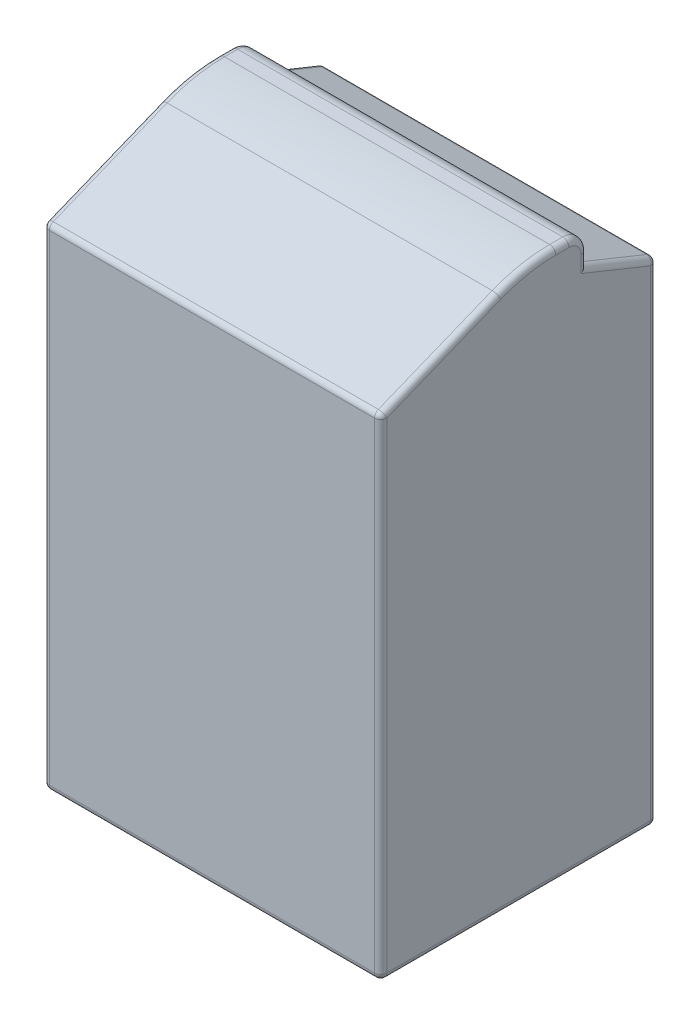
ISO-10303-21;
HEADER;
FILE_DESCRIPTION(('STEP AP214'),'2;1');
FILE_NAME('part.step','',(''),(''),'','','');
FILE_SCHEMA(('AUTOMOTIVE_DESIGN { 1 0 10303 214 1 1 1 1 }'));
ENDSEC;
DATA;
#1=APPLICATION_CONTEXT('core data for automotive mechanical design processes');
#2=APPLICATION_PROTOCOL_DEFINITION('international standard','automotive_design',2000,#1);
#3=PRODUCT_CONTEXT('',#1,'mechanical');
#4=PRODUCT('Part','Part','',(#3));
#5=PRODUCT_RELATED_PRODUCT_CATEGORY('part','',(#4));
#6=PRODUCT_DEFINITION_FORMATION('','',#4);
#7=PRODUCT_DEFINITION_CONTEXT('part definition',#1,'design');
#8=PRODUCT_DEFINITION('design','',#6,#7);
#9=PRODUCT_DEFINITION_SHAPE('','',#8);
#10=(LENGTH_UNIT() NAMED_UNIT(*) SI_UNIT(.MILLI.,.METRE.));
#11=(NAMED_UNIT(*) PLANE_ANGLE_UNIT() SI_UNIT($,.RADIAN.));
#12=(NAMED_UNIT(*) SI_UNIT($,.STERADIAN.) SOLID_ANGLE_UNIT());
#13=UNCERTAINTY_MEASURE_WITH_UNIT(LENGTH_MEASURE(1.E-05),#10,'distance_accuracy_value','');
#14=(GEOMETRIC_REPRESENTATION_CONTEXT(3) GLOBAL_UNCERTAINTY_ASSIGNED_CONTEXT((#13)) GLOBAL_UNIT_ASSIGNED_CONTEXT((#10,
#11,#12)) REPRESENTATION_CONTEXT('',''));
#15=CARTESIAN_POINT('',(0.,0.,0.));
#16=DIRECTION('',(0.,0.,1.));
#17=DIRECTION('',(1.,0.,0.));
#18=AXIS2_PLACEMENT_3D('',#15,#16,#17);
#19=CARTESIAN_POINT('',(27.5,80.,22.5));
#20=DIRECTION('',(0.,0.,-1.));
#21=DIRECTION('',(0.,1.,0.));
#22=AXIS2_PLACEMENT_3D('',#19,#20,#21);
#23=PLANE('',#22);
#24=DIRECTION('',(0.,-1.,0.));
#25=VECTOR('',#24,1.);
#26=CARTESIAN_POINT('',(26.5,80.,22.5));
#27=LINE('',#26,#25);
#28=CARTESIAN_POINT('',(26.5,1.,22.5000000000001));
#29=VERTEX_POINT('',#28);
#30=CARTESIAN_POINT('',(26.5,79.3254914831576,22.5));
#31=VERTEX_POINT('',#30);
#32=EDGE_CURVE('E294',#29,#31,#27,.F.);
#33=ORIENTED_EDGE('',*,*,#32,.T.);
#34=DIRECTION('',(-1.,0.,0.));
#35=VECTOR('',#34,1.);
#36=CARTESIAN_POINT('',(27.5,79.3254914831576,22.5));
#37=LINE('',#36,#35);
#38=CARTESIAN_POINT('',(-26.5,79.3254914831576,22.5));
#39=VERTEX_POINT('',#38);
#40=EDGE_CURVE('E296',#31,#39,#37,.T.);
#41=ORIENTED_EDGE('',*,*,#40,.T.);
#42=DIRECTION('',(0.,-1.,0.));
#43=VECTOR('',#42,1.);
#44=CARTESIAN_POINT('',(-26.5,0.,22.5000000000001));
#45=LINE('',#44,#43);
#46=CARTESIAN_POINT('',(-26.5,1.,22.5000000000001));
#47=VERTEX_POINT('',#46);
#48=EDGE_CURVE('E292',#39,#47,#45,.T.);
#49=ORIENTED_EDGE('',*,*,#48,.T.);
#50=DIRECTION('',(-1.,0.,0.));
#51=VECTOR('',#50,1.);
#52=CARTESIAN_POINT('',(27.5,1.,22.5000000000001));
#53=LINE('',#52,#51);
#54=EDGE_CURVE('E290',#47,#29,#53,.F.);
#55=ORIENTED_EDGE('',*,*,#54,.T.);
#56=EDGE_LOOP('',(#33,#41,#49,#55));
#57=FACE_BOUND('',#56,.T.);
#58=ADVANCED_FACE('F36',(#57),#23,.F.);
#59=CARTESIAN_POINT('',(27.5,0.,22.5000000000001));
#60=DIRECTION('',(0.,1.,0.));
#61=DIRECTION('',(0.,0.,1.));
#62=AXIS2_PLACEMENT_3D('',#59,#60,#61);
#63=PLANE('',#62);
#64=DIRECTION('',(0.,0.,-1.));
#65=VECTOR('',#64,1.);
#66=CARTESIAN_POINT('',(26.5,0.,22.5000000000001));
#67=LINE('',#66,#65);
#68=CARTESIAN_POINT('',(26.5,0.,-21.5));
#69=VERTEX_POINT('',#68);
#70=CARTESIAN_POINT('',(26.5,0.,21.5000000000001));
#71=VERTEX_POINT('',#70);
#72=EDGE_CURVE('E45',#69,#71,#67,.F.);
#73=ORIENTED_EDGE('',*,*,#72,.T.);
#74=DIRECTION('',(-1.,0.,0.));
#75=VECTOR('',#74,1.);
#76=CARTESIAN_POINT('',(27.5,0.,21.5000000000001));
#77=LINE('',#76,#75);
#78=CARTESIAN_POINT('',(-26.5,0.,21.5000000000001));
#79=VERTEX_POINT('',#78);
#80=EDGE_CURVE('E11',#71,#79,#77,.T.);
#81=ORIENTED_EDGE('',*,*,#80,.T.);
#82=DIRECTION('',(0.,0.,-1.));
#83=VECTOR('',#82,1.);
#84=CARTESIAN_POINT('',(-26.5,0.,-22.5));
#85=LINE('',#84,#83);
#86=CARTESIAN_POINT('',(-26.5,0.,-21.5));
#87=VERTEX_POINT('',#86);
#88=EDGE_CURVE('E299',#79,#87,#85,.T.);
#89=ORIENTED_EDGE('',*,*,#88,.T.);
#90=DIRECTION('',(-1.,0.,0.));
#91=VECTOR('',#90,1.);
#92=CARTESIAN_POINT('',(27.5,0.,-21.5));
#93=LINE('',#92,#91);
#94=EDGE_CURVE('E56',#87,#69,#93,.F.);
#95=ORIENTED_EDGE('',*,*,#94,.T.);
#96=EDGE_LOOP('',(#73,#81,#89,#95));
#97=FACE_BOUND('',#96,.T.);
#98=ADVANCED_FACE('F479',(#97),#63,.F.);
#99=CARTESIAN_POINT('',(27.5,80.,-22.5));
#100=DIRECTION('',(0.,0.,1.));
#101=DIRECTION('',(0.,-1.,0.));
#102=AXIS2_PLACEMENT_3D('',#99,#100,#101);
#103=PLANE('',#102);
#104=DIRECTION('',(-1.,0.,0.));
#105=VECTOR('',#104,1.);
#106=CARTESIAN_POINT('',(27.5,79.3254914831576,-22.5));
#107=LINE('',#106,#105);
#108=CARTESIAN_POINT('',(-26.5,79.3254914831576,-22.5));
#109=VERTEX_POINT('',#108);
#110=CARTESIAN_POINT('',(26.5,79.3254914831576,-22.5));
#111=VERTEX_POINT('',#110);
#112=EDGE_CURVE('E285',#109,#111,#107,.F.);
#113=ORIENTED_EDGE('',*,*,#112,.T.);
#114=DIRECTION('',(0.,1.,0.));
#115=VECTOR('',#114,1.);
#116=CARTESIAN_POINT('',(26.5,80.,-22.5));
#117=LINE('',#116,#115);
#118=CARTESIAN_POINT('',(26.5,1.,-22.5));
#119=VERTEX_POINT('',#118);
#120=EDGE_CURVE('E287',#111,#119,#117,.F.);
#121=ORIENTED_EDGE('',*,*,#120,.T.);
#122=DIRECTION('',(-1.,0.,0.));
#123=VECTOR('',#122,1.);
#124=CARTESIAN_POINT('',(27.5,1.,-22.5));
#125=LINE('',#124,#123);
#126=CARTESIAN_POINT('',(-26.5,1.,-22.5));
#127=VERTEX_POINT('',#126);
#128=EDGE_CURVE('E281',#119,#127,#125,.T.);
#129=ORIENTED_EDGE('',*,*,#128,.T.);
#130=DIRECTION('',(0.,1.,0.));
#131=VECTOR('',#130,1.);
#132=CARTESIAN_POINT('',(-26.5,80.,-22.5));
#133=LINE('',#132,#131);
#134=EDGE_CURVE('E283',#127,#109,#133,.T.);
#135=ORIENTED_EDGE('',*,*,#134,.T.);
#136=EDGE_LOOP('',(#113,#121,#129,#135));
#137=FACE_BOUND('',#136,.T.);
#138=ADVANCED_FACE('F460',(#137),#103,.F.);
#139=CARTESIAN_POINT('',(27.5,84.5704589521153,-11.1877171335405));
#140=DIRECTION('',(0.,-0.927183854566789,0.374606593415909));
#141=DIRECTION('',(0.,-0.374606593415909,-0.927183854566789));
#142=AXIS2_PLACEMENT_3D('',#139,#140,#141);
#143=PLANE('',#142);
#144=DIRECTION('',(-1.,0.,0.));
#145=VECTOR('',#144,1.);
#146=CARTESIAN_POINT('',(27.5,80.2526753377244,-21.8746065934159));
#147=LINE('',#146,#145);
#148=CARTESIAN_POINT('',(26.5,80.2526753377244,-21.8746065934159));
#149=VERTEX_POINT('',#148);
#150=CARTESIAN_POINT('',(-26.5,80.2526753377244,-21.8746065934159));
#151=VERTEX_POINT('',#150);
#152=EDGE_CURVE('E206',#149,#151,#147,.T.);
#153=ORIENTED_EDGE('',*,*,#152,.T.);
#154=DIRECTION('',(0.,0.374606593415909,0.927183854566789));
#155=VECTOR('',#154,1.);
#156=CARTESIAN_POINT('',(-26.5,84.5704589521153,-11.1877171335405));
#157=LINE('',#156,#155);
#158=CARTESIAN_POINT('',(-26.5,84.5704589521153,-11.1877171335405));
#159=VERTEX_POINT('',#158);
#160=EDGE_CURVE('E205',#151,#159,#157,.T.);
#161=ORIENTED_EDGE('',*,*,#160,.T.);
#162=DIRECTION('',(-1.,0.,0.));
#163=VECTOR('',#162,1.);
#164=CARTESIAN_POINT('',(27.5,84.5704589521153,-11.1877171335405));
#165=LINE('',#164,#163);
#166=CARTESIAN_POINT('',(26.5,84.5704589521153,-11.1877171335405));
#167=VERTEX_POINT('',#166);
#168=EDGE_CURVE('E188',#167,#159,#165,.T.);
#169=ORIENTED_EDGE('',*,*,#168,.F.);
#170=DIRECTION('',(0.,0.374606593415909,0.927183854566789));
#171=VECTOR('',#170,1.);
#172=CARTESIAN_POINT('',(26.5,84.5704589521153,-11.1877171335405));
#173=LINE('',#172,#171);
#174=EDGE_CURVE('E202',#167,#149,#173,.F.);
#175=ORIENTED_EDGE('',*,*,#174,.T.);
#176=EDGE_LOOP('',(#153,#161,#169,#175));
#177=FACE_BOUND('',#176,.T.);
#178=ADVANCED_FACE('F200',(#177),#143,.F.);
#179=CARTESIAN_POINT('',(27.5,86.5704589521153,-11.1877171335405));
#180=DIRECTION('',(0.,0.,1.));
#181=DIRECTION('',(0.,-1.,0.));
#182=AXIS2_PLACEMENT_3D('',#179,#180,#181);
#183=PLANE('',#182);
#184=ORIENTED_EDGE('',*,*,#168,.T.);
#185=DIRECTION('',(0.,1.,0.));
#186=VECTOR('',#185,1.);
#187=CARTESIAN_POINT('',(-26.5,86.5704589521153,-11.1877171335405));
#188=LINE('',#187,#186);
#189=CARTESIAN_POINT('',(-26.5,86.5704589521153,-11.1877171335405));
#190=VERTEX_POINT('',#189);
#191=EDGE_CURVE('E195',#159,#190,#188,.T.);
#192=ORIENTED_EDGE('',*,*,#191,.T.);
#193=DIRECTION('',(-1.,0.,0.));
#194=VECTOR('',#193,1.);
#195=CARTESIAN_POINT('',(27.5,86.5704589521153,-11.1877171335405));
#196=LINE('',#195,#194);
#197=CARTESIAN_POINT('',(26.5,86.5704589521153,-11.1877171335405));
#198=VERTEX_POINT('',#197);
#199=EDGE_CURVE('E190',#198,#190,#196,.T.);
#200=ORIENTED_EDGE('',*,*,#199,.F.);
#201=DIRECTION('',(0.,1.,0.));
#202=VECTOR('',#201,1.);
#203=CARTESIAN_POINT('',(26.5,86.5704589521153,-11.1877171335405));
#204=LINE('',#203,#202);
#205=EDGE_CURVE('E185',#198,#167,#204,.F.);
#206=ORIENTED_EDGE('',*,*,#205,.T.);
#207=EDGE_LOOP('',(#184,#192,#200,#206));
#208=FACE_BOUND('',#207,.T.);
#209=ADVANCED_FACE('F187',(#208),#183,.F.);
#210=CARTESIAN_POINT('',(27.5,86.5704589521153,-8.18771713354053));
#211=DIRECTION('',(-1.,0.,0.));
#212=DIRECTION('',(0.,0.,1.));
#213=AXIS2_PLACEMENT_3D('',#210,#211,#212);
#214=CYLINDRICAL_SURFACE('',#213,3.);
#215=ORIENTED_EDGE('',*,*,#199,.T.);
#216=CARTESIAN_POINT('',(-26.5,86.5704589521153,-8.18771713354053));
#217=DIRECTION('',(-1.,0.,0.));
#218=DIRECTION('',(0.,0.,1.));
#219=AXIS2_PLACEMENT_3D('',#216,#217,#218);
#220=CIRCLE('',#219,3.);
#221=CARTESIAN_POINT('',(-26.5,89.5704589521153,-8.18771713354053));
#222=VERTEX_POINT('',#221);
#223=EDGE_CURVE('E247',#190,#222,#220,.F.);
#224=ORIENTED_EDGE('',*,*,#223,.T.);
#225=DIRECTION('',(-1.,0.,0.));
#226=VECTOR('',#225,1.);
#227=CARTESIAN_POINT('',(27.5,89.5704589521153,-8.18771713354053));
#228=LINE('',#227,#226);
#229=CARTESIAN_POINT('',(26.5,89.5704589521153,-8.18771713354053));
#230=VERTEX_POINT('',#229);
#231=EDGE_CURVE('E403',#230,#222,#228,.T.);
#232=ORIENTED_EDGE('',*,*,#231,.F.);
#233=CARTESIAN_POINT('',(26.5,86.5704589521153,-8.18771713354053));
#234=DIRECTION('',(-1.,0.,0.));
#235=DIRECTION('',(0.,0.,1.));
#236=AXIS2_PLACEMENT_3D('',#233,#234,#235);
#237=CIRCLE('',#236,3.);
#238=EDGE_CURVE('E245',#230,#198,#237,.T.);
#239=ORIENTED_EDGE('',*,*,#238,.T.);
#240=EDGE_LOOP('',(#215,#224,#232,#239));
#241=FACE_BOUND('',#240,.T.);
#242=ADVANCED_FACE('F410',(#241),#214,.T.);
#243=CARTESIAN_POINT('',(27.5,89.5704589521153,-6.04722486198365));
#244=DIRECTION('',(0.,-1.,0.));
#245=DIRECTION('',(0.,0.,-1.));
#246=AXIS2_PLACEMENT_3D('',#243,#244,#245);
#247=PLANE('',#246);
#248=ORIENTED_EDGE('',*,*,#231,.T.);
#249=DIRECTION('',(0.,0.,1.));
#250=VECTOR('',#249,1.);
#251=CARTESIAN_POINT('',(-26.5,89.5704589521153,-6.04722486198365));
#252=LINE('',#251,#250);
#253=CARTESIAN_POINT('',(-26.5,89.5704589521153,-6.04722486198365));
#254=VERTEX_POINT('',#253);
#255=EDGE_CURVE('E251',#222,#254,#252,.T.);
#256=ORIENTED_EDGE('',*,*,#255,.T.);
#257=DIRECTION('',(-1.,0.,0.));
#258=VECTOR('',#257,1.);
#259=CARTESIAN_POINT('',(27.5,89.5704589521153,-6.04722486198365));
#260=LINE('',#259,#258);
#261=CARTESIAN_POINT('',(26.5,89.5704589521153,-6.04722486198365));
#262=VERTEX_POINT('',#261);
#263=EDGE_CURVE('E397',#262,#254,#260,.T.);
#264=ORIENTED_EDGE('',*,*,#263,.F.);
#265=DIRECTION('',(0.,0.,1.));
#266=VECTOR('',#265,1.);
#267=CARTESIAN_POINT('',(26.5,89.5704589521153,-6.04722486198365));
#268=LINE('',#267,#266);
#269=EDGE_CURVE('E249',#262,#230,#268,.F.);
#270=ORIENTED_EDGE('',*,*,#269,.T.);
#271=EDGE_LOOP('',(#248,#256,#264,#270));
#272=FACE_BOUND('',#271,.T.);
#273=ADVANCED_FACE('F752',(#272),#247,.F.);
#274=CARTESIAN_POINT('',(27.5,64.5704589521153,-6.04722486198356));
#275=DIRECTION('',(-1.,0.,0.));
#276=DIRECTION('',(0.,0.,1.));
#277=AXIS2_PLACEMENT_3D('',#274,#275,#276);
#278=CYLINDRICAL_SURFACE('',#277,25.);
#279=ORIENTED_EDGE('',*,*,#263,.T.);
#280=CARTESIAN_POINT('',(-26.5,64.5704589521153,-6.04722486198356));
#281=DIRECTION('',(-1.,0.,0.));
#282=DIRECTION('',(0.,0.,1.));
#283=AXIS2_PLACEMENT_3D('',#280,#281,#282);
#284=CIRCLE('',#283,25.);
#285=CARTESIAN_POINT('',(-26.5,87.7500553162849,3.31793997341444));
#286=VERTEX_POINT('',#285);
#287=EDGE_CURVE('E255',#254,#286,#284,.F.);
#288=ORIENTED_EDGE('',*,*,#287,.T.);
#289=DIRECTION('',(-1.,0.,0.));
#290=VECTOR('',#289,1.);
#291=CARTESIAN_POINT('',(27.5,87.7500553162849,3.31793997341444));
#292=LINE('',#291,#290);
#293=CARTESIAN_POINT('',(26.5,87.7500553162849,3.31793997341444));
#294=VERTEX_POINT('',#293);
#295=EDGE_CURVE('E391',#294,#286,#292,.T.);
#296=ORIENTED_EDGE('',*,*,#295,.F.);
#297=CARTESIAN_POINT('',(26.5,64.5704589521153,-6.04722486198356));
#298=DIRECTION('',(-1.,0.,0.));
#299=DIRECTION('',(0.,0.,1.));
#300=AXIS2_PLACEMENT_3D('',#297,#298,#299);
#301=CIRCLE('',#300,25.);
#302=EDGE_CURVE('E253',#294,#262,#301,.T.);
#303=ORIENTED_EDGE('',*,*,#302,.T.);
#304=EDGE_LOOP('',(#279,#288,#296,#303));
#305=FACE_BOUND('',#304,.T.);
#306=ADVANCED_FACE('F744',(#305),#278,.T.);
#307=CARTESIAN_POINT('',(27.5,80.,22.5));
#308=DIRECTION('',(0.,-0.927183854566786,-0.374606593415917));
#309=DIRECTION('',(0.,0.374606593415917,-0.927183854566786));
#310=AXIS2_PLACEMENT_3D('',#307,#308,#309);
#311=PLANE('',#310);
#312=ORIENTED_EDGE('',*,*,#295,.T.);
#313=DIRECTION('',(0.,-0.374606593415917,0.927183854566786));
#314=VECTOR('',#313,1.);
#315=CARTESIAN_POINT('',(-26.5,80.,22.5));
#316=LINE('',#315,#314);
#317=CARTESIAN_POINT('',(-26.5,80.2526753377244,21.8746065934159));
#318=VERTEX_POINT('',#317);
#319=EDGE_CURVE('E261',#286,#318,#316,.T.);
#320=ORIENTED_EDGE('',*,*,#319,.T.);
#321=DIRECTION('',(-1.,0.,0.));
#322=VECTOR('',#321,1.);
#323=CARTESIAN_POINT('',(27.5,80.2526753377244,21.8746065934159));
#324=LINE('',#323,#322);
#325=CARTESIAN_POINT('',(26.5,80.2526753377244,21.8746065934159));
#326=VERTEX_POINT('',#325);
#327=EDGE_CURVE('E257',#318,#326,#324,.F.);
#328=ORIENTED_EDGE('',*,*,#327,.T.);
#329=DIRECTION('',(0.,-0.374606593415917,0.927183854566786));
#330=VECTOR('',#329,1.);
#331=CARTESIAN_POINT('',(26.5,80.,22.5));
#332=LINE('',#331,#330);
#333=EDGE_CURVE('E259',#326,#294,#332,.F.);
#334=ORIENTED_EDGE('',*,*,#333,.T.);
#335=EDGE_LOOP('',(#312,#320,#328,#334));
#336=FACE_BOUND('',#335,.T.);
#337=ADVANCED_FACE('F735',(#336),#311,.F.);
#338=CARTESIAN_POINT('',(27.5,86.5704589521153,-8.18771713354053));
#339=DIRECTION('',(-1.,0.,0.));
#340=DIRECTION('',(0.,0.,1.));
#341=AXIS2_PLACEMENT_3D('',#338,#339,#340);
#342=PLANE('',#341);
#343=CARTESIAN_POINT('',(27.5,64.5704589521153,-6.04722486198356));
#344=DIRECTION('',(-1.,0.,0.));
#345=DIRECTION('',(0.,0.,1.));
#346=AXIS2_PLACEMENT_3D('',#343,#344,#345);
#347=CIRCLE('',#346,24.);
#348=CARTESIAN_POINT('',(27.5,88.5704589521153,-6.04722486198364));
#349=VERTEX_POINT('',#348);
#350=CARTESIAN_POINT('',(27.5,86.8228714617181,2.94333337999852));
#351=VERTEX_POINT('',#350);
#352=EDGE_CURVE('E276',#349,#351,#347,.F.);
#353=ORIENTED_EDGE('',*,*,#352,.T.);
#354=DIRECTION('',(0.,-0.374606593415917,0.927183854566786));
#355=VECTOR('',#354,1.);
#356=CARTESIAN_POINT('',(27.5,90.653589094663,-6.5380254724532));
#357=LINE('',#356,#355);
#358=CARTESIAN_POINT('',(27.5,79.3254914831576,21.5));
#359=VERTEX_POINT('',#358);
#360=EDGE_CURVE('E278',#351,#359,#357,.T.);
#361=ORIENTED_EDGE('',*,*,#360,.T.);
#362=DIRECTION('',(0.,-1.,0.));
#363=VECTOR('',#362,1.);
#364=CARTESIAN_POINT('',(27.5,86.5704589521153,21.5));
#365=LINE('',#364,#363);
#366=CARTESIAN_POINT('',(27.5,1.,21.5000000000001));
#367=VERTEX_POINT('',#366);
#368=EDGE_CURVE('E265',#359,#367,#365,.T.);
#369=ORIENTED_EDGE('',*,*,#368,.T.);
#370=DIRECTION('',(0.,0.,-1.));
#371=VECTOR('',#370,1.);
#372=CARTESIAN_POINT('',(27.5,1.,-8.18771713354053));
#373=LINE('',#372,#371);
#374=CARTESIAN_POINT('',(27.5,1.,-21.5));
#375=VERTEX_POINT('',#374);
#376=EDGE_CURVE('E263',#367,#375,#373,.T.);
#377=ORIENTED_EDGE('',*,*,#376,.T.);
#378=DIRECTION('',(0.,1.,0.));
#379=VECTOR('',#378,1.);
#380=CARTESIAN_POINT('',(27.5,86.5704589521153,-21.5));
#381=LINE('',#380,#379);
#382=CARTESIAN_POINT('',(27.5,79.3254914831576,-21.5));
#383=VERTEX_POINT('',#382);
#384=EDGE_CURVE('E267',#375,#383,#381,.T.);
#385=ORIENTED_EDGE('',*,*,#384,.T.);
#386=DIRECTION('',(0.,0.374606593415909,0.927183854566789));
#387=VECTOR('',#386,1.);
#388=CARTESIAN_POINT('',(27.5,84.9659228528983,-7.53944246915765));
#389=LINE('',#388,#387);
#390=CARTESIAN_POINT('',(27.5,83.8959504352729,-10.1877171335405));
#391=VERTEX_POINT('',#390);
#392=EDGE_CURVE('E269',#383,#391,#389,.T.);
#393=ORIENTED_EDGE('',*,*,#392,.T.);
#394=DIRECTION('',(0.,1.,0.));
#395=VECTOR('',#394,1.);
#396=CARTESIAN_POINT('',(27.5,86.5704589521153,-10.1877171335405));
#397=LINE('',#396,#395);
#398=CARTESIAN_POINT('',(27.5,86.5704589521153,-10.1877171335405));
#399=VERTEX_POINT('',#398);
#400=EDGE_CURVE('E212',#391,#399,#397,.T.);
#401=ORIENTED_EDGE('',*,*,#400,.T.);
#402=CARTESIAN_POINT('',(27.5,86.5704589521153,-8.18771713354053));
#403=DIRECTION('',(-1.,0.,0.));
#404=DIRECTION('',(0.,0.,1.));
#405=AXIS2_PLACEMENT_3D('',#402,#403,#404);
#406=CIRCLE('',#405,2.);
#407=CARTESIAN_POINT('',(27.5,88.5704589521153,-8.18771713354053));
#408=VERTEX_POINT('',#407);
#409=EDGE_CURVE('E272',#399,#408,#406,.F.);
#410=ORIENTED_EDGE('',*,*,#409,.T.);
#411=DIRECTION('',(0.,0.,1.));
#412=VECTOR('',#411,1.);
#413=CARTESIAN_POINT('',(27.5,88.5704589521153,-8.18771713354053));
#414=LINE('',#413,#412);
#415=EDGE_CURVE('E274',#408,#349,#414,.T.);
#416=ORIENTED_EDGE('',*,*,#415,.T.);
#417=EDGE_LOOP('',(#353,#361,#369,#377,#385,#393,#401,#410,#416));
#418=FACE_BOUND('',#417,.T.);
#419=ADVANCED_FACE('F727',(#418),#342,.F.);
#420=CARTESIAN_POINT('',(-27.5,86.5704589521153,-8.18771713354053));
#421=DIRECTION('',(-1.,0.,0.));
#422=DIRECTION('',(0.,0.,1.));
#423=AXIS2_PLACEMENT_3D('',#420,#421,#422);
#424=PLANE('',#423);
#425=DIRECTION('',(0.,1.,0.));
#426=VECTOR('',#425,1.);
#427=CARTESIAN_POINT('',(-27.5,84.5704589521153,-10.1877171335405));
#428=LINE('',#427,#426);
#429=CARTESIAN_POINT('',(-27.5,86.5704589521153,-10.1877171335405));
#430=VERTEX_POINT('',#429);
#431=CARTESIAN_POINT('',(-27.5,83.8959504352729,-10.1877171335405));
#432=VERTEX_POINT('',#431);
#433=EDGE_CURVE('E240',#430,#432,#428,.F.);
#434=ORIENTED_EDGE('',*,*,#433,.T.);
#435=DIRECTION('',(0.,0.374606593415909,0.927183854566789));
#436=VECTOR('',#435,1.);
#437=CARTESIAN_POINT('',(-27.5,79.0728161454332,-22.1253934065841));
#438=LINE('',#437,#436);
#439=CARTESIAN_POINT('',(-27.5,79.3254914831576,-21.5));
#440=VERTEX_POINT('',#439);
#441=EDGE_CURVE('E196',#432,#440,#438,.F.);
#442=ORIENTED_EDGE('',*,*,#441,.T.);
#443=DIRECTION('',(0.,1.,0.));
#444=VECTOR('',#443,1.);
#445=CARTESIAN_POINT('',(-27.5,0.,-21.5));
#446=LINE('',#445,#444);
#447=CARTESIAN_POINT('',(-27.5,0.999999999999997,-21.5));
#448=VERTEX_POINT('',#447);
#449=EDGE_CURVE('E230',#440,#448,#446,.F.);
#450=ORIENTED_EDGE('',*,*,#449,.T.);
#451=DIRECTION('',(0.,0.,-1.));
#452=VECTOR('',#451,1.);
#453=CARTESIAN_POINT('',(-27.5,1.,22.5000000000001));
#454=LINE('',#453,#452);
#455=CARTESIAN_POINT('',(-27.5,1.,21.5000000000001));
#456=VERTEX_POINT('',#455);
#457=EDGE_CURVE('E223',#448,#456,#454,.F.);
#458=ORIENTED_EDGE('',*,*,#457,.T.);
#459=DIRECTION('',(0.,-1.,0.));
#460=VECTOR('',#459,1.);
#461=CARTESIAN_POINT('',(-27.5,80.,21.5));
#462=LINE('',#461,#460);
#463=CARTESIAN_POINT('',(-27.5,79.3254914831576,21.5));
#464=VERTEX_POINT('',#463);
#465=EDGE_CURVE('E228',#456,#464,#462,.F.);
#466=ORIENTED_EDGE('',*,*,#465,.T.);
#467=DIRECTION('',(0.,-0.374606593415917,0.927183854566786));
#468=VECTOR('',#467,1.);
#469=CARTESIAN_POINT('',(-27.5,86.8228714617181,2.94333337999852));
#470=LINE('',#469,#468);
#471=CARTESIAN_POINT('',(-27.5,86.8228714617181,2.94333337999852));
#472=VERTEX_POINT('',#471);
#473=EDGE_CURVE('E232',#464,#472,#470,.F.);
#474=ORIENTED_EDGE('',*,*,#473,.T.);
#475=CARTESIAN_POINT('',(-27.5,64.5704589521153,-6.04722486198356));
#476=DIRECTION('',(-1.,0.,0.));
#477=DIRECTION('',(0.,0.,1.));
#478=AXIS2_PLACEMENT_3D('',#475,#476,#477);
#479=CIRCLE('',#478,24.);
#480=CARTESIAN_POINT('',(-27.5,88.5704589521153,-6.04722486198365));
#481=VERTEX_POINT('',#480);
#482=EDGE_CURVE('E234',#472,#481,#479,.T.);
#483=ORIENTED_EDGE('',*,*,#482,.T.);
#484=DIRECTION('',(0.,0.,1.));
#485=VECTOR('',#484,1.);
#486=CARTESIAN_POINT('',(-27.5,88.5704589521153,-8.18771713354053));
#487=LINE('',#486,#485);
#488=CARTESIAN_POINT('',(-27.5,88.5704589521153,-8.18771713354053));
#489=VERTEX_POINT('',#488);
#490=EDGE_CURVE('E236',#481,#489,#487,.F.);
#491=ORIENTED_EDGE('',*,*,#490,.T.);
#492=CARTESIAN_POINT('',(-27.5,86.5704589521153,-8.18771713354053));
#493=DIRECTION('',(-1.,0.,0.));
#494=DIRECTION('',(0.,0.,1.));
#495=AXIS2_PLACEMENT_3D('',#492,#493,#494);
#496=CIRCLE('',#495,2.);
#497=EDGE_CURVE('E238',#489,#430,#496,.T.);
#498=ORIENTED_EDGE('',*,*,#497,.T.);
#499=EDGE_LOOP('',(#434,#442,#450,#458,#466,#474,#483,#491,#498));
#500=FACE_BOUND('',#499,.T.);
#501=ADVANCED_FACE('F425',(#500),#424,.T.);
#502=CARTESIAN_POINT('',(26.5,90.653589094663,-6.5380254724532));
#503=DIRECTION('',(0.,-0.374606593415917,0.927183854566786));
#504=DIRECTION('',(0.,-0.927183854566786,-0.374606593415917));
#505=AXIS2_PLACEMENT_3D('',#502,#503,#504);
#506=CYLINDRICAL_SURFACE('',#505,1.);
#507=CARTESIAN_POINT('',(26.5,79.3254914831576,21.5));
#508=DIRECTION('',(0.,-0.374606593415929,0.927183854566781));
#509=DIRECTION('',(0.,-0.927183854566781,-0.374606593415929));
#510=AXIS2_PLACEMENT_3D('',#507,#508,#509);
#511=CIRCLE('',#510,1.);
#512=EDGE_CURVE('E385',#359,#326,#511,.T.);
#513=ORIENTED_EDGE('',*,*,#512,.F.);
#514=ORIENTED_EDGE('',*,*,#360,.F.);
#515=CARTESIAN_POINT('',(26.5,86.8228714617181,2.94333337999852));
#516=DIRECTION('',(0.,0.374606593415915,-0.927183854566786));
#517=DIRECTION('',(0.,0.927183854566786,0.374606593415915));
#518=AXIS2_PLACEMENT_3D('',#515,#516,#517);
#519=CIRCLE('',#518,1.);
#520=EDGE_CURVE('E40',#294,#351,#519,.T.);
#521=ORIENTED_EDGE('',*,*,#520,.F.);
#522=ORIENTED_EDGE('',*,*,#333,.F.);
#523=EDGE_LOOP('',(#513,#514,#521,#522));
#524=FACE_BOUND('',#523,.T.);
#525=ADVANCED_FACE('F38',(#524),#506,.T.);
#526=CARTESIAN_POINT('',(26.5,86.5704589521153,21.5));
#527=DIRECTION('',(0.,-1.,0.));
#528=DIRECTION('',(0.,0.,-1.));
#529=AXIS2_PLACEMENT_3D('',#526,#527,#528);
#530=CYLINDRICAL_SURFACE('',#529,1.);
#531=CARTESIAN_POINT('',(26.5,1.,21.5000000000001));
#532=DIRECTION('',(0.,-1.,0.));
#533=DIRECTION('',(0.,0.,-1.));
#534=AXIS2_PLACEMENT_3D('',#531,#532,#533);
#535=CIRCLE('',#534,1.);
#536=EDGE_CURVE('E381',#367,#29,#535,.T.);
#537=ORIENTED_EDGE('',*,*,#536,.F.);
#538=ORIENTED_EDGE('',*,*,#368,.F.);
#539=CARTESIAN_POINT('',(26.5,79.3254914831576,21.5));
#540=DIRECTION('',(0.,1.,0.));
#541=DIRECTION('',(-1.,0.,0.));
#542=AXIS2_PLACEMENT_3D('',#539,#540,#541);
#543=CIRCLE('',#542,1.);
#544=EDGE_CURVE('E384',#31,#359,#543,.T.);
#545=ORIENTED_EDGE('',*,*,#544,.F.);
#546=ORIENTED_EDGE('',*,*,#32,.F.);
#547=EDGE_LOOP('',(#537,#538,#545,#546));
#548=FACE_BOUND('',#547,.T.);
#549=ADVANCED_FACE('F705',(#548),#530,.T.);
#550=CARTESIAN_POINT('',(26.5,64.5704589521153,-6.04722486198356));
#551=DIRECTION('',(-1.,0.,0.));
#552=DIRECTION('',(0.,0.,1.));
#553=AXIS2_PLACEMENT_3D('',#550,#551,#552);
#554=TOROIDAL_SURFACE('',#553,24.,1.);
#555=ORIENTED_EDGE('',*,*,#520,.T.);
#556=ORIENTED_EDGE('',*,*,#352,.F.);
#557=CARTESIAN_POINT('',(26.5,88.5704589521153,-6.04722486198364));
#558=DIRECTION('',(0.,0.,-1.));
#559=DIRECTION('',(0.,1.,0.));
#560=AXIS2_PLACEMENT_3D('',#557,#558,#559);
#561=CIRCLE('',#560,1.);
#562=EDGE_CURVE('E378',#262,#349,#561,.T.);
#563=ORIENTED_EDGE('',*,*,#562,.F.);
#564=ORIENTED_EDGE('',*,*,#302,.F.);
#565=EDGE_LOOP('',(#555,#556,#563,#564));
#566=FACE_BOUND('',#565,.T.);
#567=ADVANCED_FACE('F697',(#566),#554,.T.);
#568=CARTESIAN_POINT('',(26.5,79.3254914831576,21.5));
#569=DIRECTION('',(1.,0.,0.));
#570=DIRECTION('',(0.,1.,0.));
#571=AXIS2_PLACEMENT_3D('',#568,#569,#570);
#572=SPHERICAL_SURFACE('',#571,1.);
#573=ORIENTED_EDGE('',*,*,#544,.T.);
#574=ORIENTED_EDGE('',*,*,#512,.T.);
#575=CARTESIAN_POINT('',(26.5,79.3254914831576,21.5));
#576=DIRECTION('',(1.,0.,0.));
#577=DIRECTION('',(0.,0.,-1.));
#578=AXIS2_PLACEMENT_3D('',#575,#576,#577);
#579=CIRCLE('',#578,1.);
#580=EDGE_CURVE('E375',#31,#326,#579,.F.);
#581=ORIENTED_EDGE('',*,*,#580,.F.);
#582=EDGE_LOOP('',(#573,#574,#581));
#583=FACE_BOUND('',#582,.T.);
#584=ADVANCED_FACE('F688',(#583),#572,.T.);
#585=CARTESIAN_POINT('',(26.5,1.,21.5000000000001));
#586=DIRECTION('',(0.,0.,1.));
#587=DIRECTION('',(0.,-1.,0.));
#588=AXIS2_PLACEMENT_3D('',#585,#586,#587);
#589=SPHERICAL_SURFACE('',#588,1.);
#590=CARTESIAN_POINT('',(26.5,1.,21.5000000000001));
#591=DIRECTION('',(0.,0.,1.));
#592=DIRECTION('',(1.,0.,0.));
#593=AXIS2_PLACEMENT_3D('',#590,#591,#592);
#594=CIRCLE('',#593,1.);
#595=EDGE_CURVE('E370',#367,#71,#594,.F.);
#596=ORIENTED_EDGE('',*,*,#595,.F.);
#597=ORIENTED_EDGE('',*,*,#536,.T.);
#598=CARTESIAN_POINT('',(26.5,1.,21.5000000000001));
#599=DIRECTION('',(1.,0.,0.));
#600=DIRECTION('',(0.,0.,-1.));
#601=AXIS2_PLACEMENT_3D('',#598,#599,#600);
#602=CIRCLE('',#601,1.);
#603=EDGE_CURVE('E372',#71,#29,#602,.F.);
#604=ORIENTED_EDGE('',*,*,#603,.F.);
#605=EDGE_LOOP('',(#596,#597,#604));
#606=FACE_BOUND('',#605,.T.);
#607=ADVANCED_FACE('F679',(#606),#589,.T.);
#608=CARTESIAN_POINT('',(26.5,88.5704589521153,-8.18771713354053));
#609=DIRECTION('',(0.,0.,1.));
#610=DIRECTION('',(1.,0.,0.));
#611=AXIS2_PLACEMENT_3D('',#608,#609,#610);
#612=CYLINDRICAL_SURFACE('',#611,1.);
#613=ORIENTED_EDGE('',*,*,#562,.T.);
#614=ORIENTED_EDGE('',*,*,#415,.F.);
#615=CARTESIAN_POINT('',(26.5,88.5704589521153,-8.18771713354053));
#616=DIRECTION('',(0.,0.,-1.));
#617=DIRECTION('',(-1.,0.,0.));
#618=AXIS2_PLACEMENT_3D('',#615,#616,#617);
#619=CIRCLE('',#618,1.);
#620=EDGE_CURVE('E367',#230,#408,#619,.T.);
#621=ORIENTED_EDGE('',*,*,#620,.F.);
#622=ORIENTED_EDGE('',*,*,#269,.F.);
#623=EDGE_LOOP('',(#613,#614,#621,#622));
#624=FACE_BOUND('',#623,.T.);
#625=ADVANCED_FACE('F670',(#624),#612,.T.);
#626=CARTESIAN_POINT('',(27.5,79.3254914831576,21.5));
#627=DIRECTION('',(-1.,0.,0.));
#628=DIRECTION('',(0.,0.,1.));
#629=AXIS2_PLACEMENT_3D('',#626,#627,#628);
#630=CYLINDRICAL_SURFACE('',#629,1.);
#631=ORIENTED_EDGE('',*,*,#580,.T.);
#632=ORIENTED_EDGE('',*,*,#327,.F.);
#633=CARTESIAN_POINT('',(-26.5,79.3254914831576,21.5));
#634=DIRECTION('',(-1.,0.,0.));
#635=DIRECTION('',(0.,0.,1.));
#636=AXIS2_PLACEMENT_3D('',#633,#634,#635);
#637=CIRCLE('',#636,1.);
#638=EDGE_CURVE('E364',#39,#318,#637,.T.);
#639=ORIENTED_EDGE('',*,*,#638,.F.);
#640=ORIENTED_EDGE('',*,*,#40,.F.);
#641=EDGE_LOOP('',(#631,#632,#639,#640));
#642=FACE_BOUND('',#641,.T.);
#643=ADVANCED_FACE('F661',(#642),#630,.T.);
#644=CARTESIAN_POINT('',(-26.5,80.,21.5));
#645=DIRECTION('',(0.,1.,0.));
#646=DIRECTION('',(0.,0.,1.));
#647=AXIS2_PLACEMENT_3D('',#644,#645,#646);
#648=CYLINDRICAL_SURFACE('',#647,1.);
#649=CARTESIAN_POINT('',(-26.5,1.,21.5000000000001));
#650=DIRECTION('',(0.,-1.,0.));
#651=DIRECTION('',(0.,0.,-1.));
#652=AXIS2_PLACEMENT_3D('',#649,#650,#651);
#653=CIRCLE('',#652,1.);
#654=EDGE_CURVE('E359',#47,#456,#653,.T.);
#655=ORIENTED_EDGE('',*,*,#654,.F.);
#656=ORIENTED_EDGE('',*,*,#48,.F.);
#657=CARTESIAN_POINT('',(-26.5,79.3254914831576,21.5));
#658=DIRECTION('',(0.,1.,0.));
#659=DIRECTION('',(0.,0.,1.));
#660=AXIS2_PLACEMENT_3D('',#657,#658,#659);
#661=CIRCLE('',#660,1.);
#662=EDGE_CURVE('E362',#464,#39,#661,.T.);
#663=ORIENTED_EDGE('',*,*,#662,.F.);
#664=ORIENTED_EDGE('',*,*,#465,.F.);
#665=EDGE_LOOP('',(#655,#656,#663,#664));
#666=FACE_BOUND('',#665,.T.);
#667=ADVANCED_FACE('F652',(#666),#648,.T.);
#668=CARTESIAN_POINT('',(27.5,1.,21.5000000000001));
#669=DIRECTION('',(-1.,0.,0.));
#670=DIRECTION('',(0.,0.,1.));
#671=AXIS2_PLACEMENT_3D('',#668,#669,#670);
#672=CYLINDRICAL_SURFACE('',#671,1.);
#673=ORIENTED_EDGE('',*,*,#603,.T.);
#674=ORIENTED_EDGE('',*,*,#54,.F.);
#675=CARTESIAN_POINT('',(-26.5,1.,21.5000000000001));
#676=DIRECTION('',(-1.,0.,0.));
#677=DIRECTION('',(0.,0.,1.));
#678=AXIS2_PLACEMENT_3D('',#675,#676,#677);
#679=CIRCLE('',#678,1.);
#680=EDGE_CURVE('E356',#79,#47,#679,.T.);
#681=ORIENTED_EDGE('',*,*,#680,.F.);
#682=ORIENTED_EDGE('',*,*,#80,.F.);
#683=EDGE_LOOP('',(#673,#674,#681,#682));
#684=FACE_BOUND('',#683,.T.);
#685=ADVANCED_FACE('F643',(#684),#672,.T.);
#686=CARTESIAN_POINT('',(26.5,1.,-8.18771713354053));
#687=DIRECTION('',(0.,0.,-1.));
#688=DIRECTION('',(0.,1.,0.));
#689=AXIS2_PLACEMENT_3D('',#686,#687,#688);
#690=CYLINDRICAL_SURFACE('',#689,1.);
#691=ORIENTED_EDGE('',*,*,#595,.T.);
#692=ORIENTED_EDGE('',*,*,#72,.F.);
#693=CARTESIAN_POINT('',(26.5,1.,-21.5));
#694=DIRECTION('',(0.,0.,-1.));
#695=DIRECTION('',(-1.,0.,0.));
#696=AXIS2_PLACEMENT_3D('',#693,#694,#695);
#697=CIRCLE('',#696,1.);
#698=EDGE_CURVE('E353',#375,#69,#697,.T.);
#699=ORIENTED_EDGE('',*,*,#698,.F.);
#700=ORIENTED_EDGE('',*,*,#376,.F.);
#701=EDGE_LOOP('',(#691,#692,#699,#700));
#702=FACE_BOUND('',#701,.T.);
#703=ADVANCED_FACE('F634',(#702),#690,.T.);
#704=CARTESIAN_POINT('',(26.5,86.5704589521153,-8.18771713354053));
#705=DIRECTION('',(-1.,0.,0.));
#706=DIRECTION('',(0.,0.,1.));
#707=AXIS2_PLACEMENT_3D('',#704,#705,#706);
#708=TOROIDAL_SURFACE('',#707,2.,1.);
#709=ORIENTED_EDGE('',*,*,#620,.T.);
#710=ORIENTED_EDGE('',*,*,#409,.F.);
#711=CARTESIAN_POINT('',(26.5,86.5704589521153,-10.1877171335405));
#712=DIRECTION('',(0.,-1.,0.));
#713=DIRECTION('',(0.,0.,-1.));
#714=AXIS2_PLACEMENT_3D('',#711,#712,#713);
#715=CIRCLE('',#714,1.);
#716=EDGE_CURVE('E351',#198,#399,#715,.T.);
#717=ORIENTED_EDGE('',*,*,#716,.F.);
#718=ORIENTED_EDGE('',*,*,#238,.F.);
#719=EDGE_LOOP('',(#709,#710,#717,#718));
#720=FACE_BOUND('',#719,.T.);
#721=ADVANCED_FACE('F625',(#720),#708,.T.);
#722=CARTESIAN_POINT('',(-26.5,79.3254914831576,21.5));
#723=DIRECTION('',(-1.,0.,0.));
#724=DIRECTION('',(0.,0.,1.));
#725=AXIS2_PLACEMENT_3D('',#722,#723,#724);
#726=SPHERICAL_SURFACE('',#725,1.);
#727=ORIENTED_EDGE('',*,*,#662,.T.);
#728=ORIENTED_EDGE('',*,*,#638,.T.);
#729=CARTESIAN_POINT('',(-26.5,79.3254914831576,21.5));
#730=DIRECTION('',(0.,-0.374606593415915,0.927183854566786));
#731=DIRECTION('',(0.,-0.927183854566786,-0.374606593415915));
#732=AXIS2_PLACEMENT_3D('',#729,#730,#731);
#733=CIRCLE('',#732,1.);
#734=EDGE_CURVE('E348',#464,#318,#733,.F.);
#735=ORIENTED_EDGE('',*,*,#734,.F.);
#736=EDGE_LOOP('',(#727,#728,#735));
#737=FACE_BOUND('',#736,.T.);
#738=ADVANCED_FACE('F616',(#737),#726,.T.);
#739=CARTESIAN_POINT('',(-26.5,1.,21.5000000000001));
#740=DIRECTION('',(0.,0.,1.));
#741=DIRECTION('',(0.,-1.,0.));
#742=AXIS2_PLACEMENT_3D('',#739,#740,#741);
#743=SPHERICAL_SURFACE('',#742,1.);
#744=ORIENTED_EDGE('',*,*,#680,.T.);
#745=ORIENTED_EDGE('',*,*,#654,.T.);
#746=CARTESIAN_POINT('',(-26.5,1.,21.5000000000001));
#747=DIRECTION('',(0.,0.,1.));
#748=DIRECTION('',(1.,0.,0.));
#749=AXIS2_PLACEMENT_3D('',#746,#747,#748);
#750=CIRCLE('',#749,1.);
#751=EDGE_CURVE('E345',#79,#456,#750,.F.);
#752=ORIENTED_EDGE('',*,*,#751,.F.);
#753=EDGE_LOOP('',(#744,#745,#752));
#754=FACE_BOUND('',#753,.T.);
#755=ADVANCED_FACE('F608',(#754),#743,.T.);
#756=CARTESIAN_POINT('',(26.5,0.999999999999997,-21.5));
#757=DIRECTION('',(0.,-1.,0.));
#758=DIRECTION('',(0.,0.,-1.));
#759=AXIS2_PLACEMENT_3D('',#756,#757,#758);
#760=SPHERICAL_SURFACE('',#759,1.);
#761=CARTESIAN_POINT('',(26.5,1.,-21.5));
#762=DIRECTION('',(0.,-1.,0.));
#763=DIRECTION('',(1.,0.,0.));
#764=AXIS2_PLACEMENT_3D('',#761,#762,#763);
#765=CIRCLE('',#764,1.);
#766=EDGE_CURVE('E215',#375,#119,#765,.F.);
#767=ORIENTED_EDGE('',*,*,#766,.F.);
#768=ORIENTED_EDGE('',*,*,#698,.T.);
#769=CARTESIAN_POINT('',(26.5,0.999999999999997,-21.5));
#770=DIRECTION('',(1.,0.,0.));
#771=DIRECTION('',(0.,0.,-1.));
#772=AXIS2_PLACEMENT_3D('',#769,#770,#771);
#773=CIRCLE('',#772,1.);
#774=EDGE_CURVE('E342',#119,#69,#773,.F.);
#775=ORIENTED_EDGE('',*,*,#774,.F.);
#776=EDGE_LOOP('',(#767,#768,#775));
#777=FACE_BOUND('',#776,.T.);
#778=ADVANCED_FACE('F452',(#777),#760,.T.);
#779=CARTESIAN_POINT('',(26.5,86.5704589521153,-10.1877171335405));
#780=DIRECTION('',(0.,1.,0.));
#781=DIRECTION('',(0.,0.,1.));
#782=AXIS2_PLACEMENT_3D('',#779,#780,#781);
#783=CYLINDRICAL_SURFACE('',#782,1.);
#784=ORIENTED_EDGE('',*,*,#716,.T.);
#785=ORIENTED_EDGE('',*,*,#400,.F.);
#786=CARTESIAN_POINT('',(26.5,83.8959504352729,-10.1877171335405));
#787=DIRECTION('',(0.,0.829037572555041,0.559192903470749));
#788=DIRECTION('',(0.,0.559192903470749,-0.829037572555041));
#789=AXIS2_PLACEMENT_3D('',#786,#787,#788);
#790=ELLIPSE('',#789,1.20621794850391,1.);
#791=EDGE_CURVE('E210',#167,#391,#790,.F.);
#792=ORIENTED_EDGE('',*,*,#791,.F.);
#793=ORIENTED_EDGE('',*,*,#205,.F.);
#794=EDGE_LOOP('',(#784,#785,#792,#793));
#795=FACE_BOUND('',#794,.T.);
#796=ADVANCED_FACE('F211',(#795),#783,.T.);
#797=CARTESIAN_POINT('',(-26.5,79.0728161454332,22.1253934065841));
#798=DIRECTION('',(0.,0.374606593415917,-0.927183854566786));
#799=DIRECTION('',(0.,0.927183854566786,0.374606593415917));
#800=AXIS2_PLACEMENT_3D('',#797,#798,#799);
#801=CYLINDRICAL_SURFACE('',#800,1.);
#802=ORIENTED_EDGE('',*,*,#734,.T.);
#803=ORIENTED_EDGE('',*,*,#319,.F.);
#804=CARTESIAN_POINT('',(-26.5,86.8228714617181,2.94333337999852));
#805=DIRECTION('',(0.,0.374606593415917,-0.927183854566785));
#806=DIRECTION('',(0.,0.927183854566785,0.374606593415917));
#807=AXIS2_PLACEMENT_3D('',#804,#805,#806);
#808=CIRCLE('',#807,1.);
#809=EDGE_CURVE('E216',#472,#286,#808,.T.);
#810=ORIENTED_EDGE('',*,*,#809,.F.);
#811=ORIENTED_EDGE('',*,*,#473,.F.);
#812=EDGE_LOOP('',(#802,#803,#810,#811));
#813=FACE_BOUND('',#812,.T.);
#814=ADVANCED_FACE('F585',(#813),#801,.T.);
#815=CARTESIAN_POINT('',(-26.5,1.,22.5000000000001));
#816=DIRECTION('',(0.,0.,1.));
#817=DIRECTION('',(0.,-1.,0.));
#818=AXIS2_PLACEMENT_3D('',#815,#816,#817);
#819=CYLINDRICAL_SURFACE('',#818,1.);
#820=ORIENTED_EDGE('',*,*,#751,.T.);
#821=ORIENTED_EDGE('',*,*,#457,.F.);
#822=CARTESIAN_POINT('',(-26.5,0.999999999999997,-21.5));
#823=DIRECTION('',(0.,0.,-1.));
#824=DIRECTION('',(-1.,0.,0.));
#825=AXIS2_PLACEMENT_3D('',#822,#823,#824);
#826=CIRCLE('',#825,1.);
#827=EDGE_CURVE('E335',#87,#448,#826,.T.);
#828=ORIENTED_EDGE('',*,*,#827,.F.);
#829=ORIENTED_EDGE('',*,*,#88,.F.);
#830=EDGE_LOOP('',(#820,#821,#828,#829));
#831=FACE_BOUND('',#830,.T.);
#832=ADVANCED_FACE('F442',(#831),#819,.T.);
#833=CARTESIAN_POINT('',(27.5,1.,-21.5));
#834=DIRECTION('',(-1.,0.,0.));
#835=DIRECTION('',(0.,0.,1.));
#836=AXIS2_PLACEMENT_3D('',#833,#834,#835);
#837=CYLINDRICAL_SURFACE('',#836,1.);
#838=ORIENTED_EDGE('',*,*,#774,.T.);
#839=ORIENTED_EDGE('',*,*,#94,.F.);
#840=CARTESIAN_POINT('',(-26.5,1.,-21.5));
#841=DIRECTION('',(-1.,0.,0.));
#842=DIRECTION('',(0.,0.,1.));
#843=AXIS2_PLACEMENT_3D('',#840,#841,#842);
#844=CIRCLE('',#843,1.);
#845=EDGE_CURVE('E332',#127,#87,#844,.T.);
#846=ORIENTED_EDGE('',*,*,#845,.F.);
#847=ORIENTED_EDGE('',*,*,#128,.F.);
#848=EDGE_LOOP('',(#838,#839,#846,#847));
#849=FACE_BOUND('',#848,.T.);
#850=ADVANCED_FACE('F448',(#849),#837,.T.);
#851=CARTESIAN_POINT('',(26.5,86.5704589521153,-21.5));
#852=DIRECTION('',(0.,1.,0.));
#853=DIRECTION('',(0.,0.,1.));
#854=AXIS2_PLACEMENT_3D('',#851,#852,#853);
#855=CYLINDRICAL_SURFACE('',#854,1.);
#856=ORIENTED_EDGE('',*,*,#766,.T.);
#857=ORIENTED_EDGE('',*,*,#120,.F.);
#858=CARTESIAN_POINT('',(26.5,79.3254914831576,-21.5));
#859=DIRECTION('',(0.,1.,0.));
#860=DIRECTION('',(0.,0.,1.));
#861=AXIS2_PLACEMENT_3D('',#858,#859,#860);
#862=CIRCLE('',#861,1.);
#863=EDGE_CURVE('E329',#383,#111,#862,.T.);
#864=ORIENTED_EDGE('',*,*,#863,.F.);
#865=ORIENTED_EDGE('',*,*,#384,.F.);
#866=EDGE_LOOP('',(#856,#857,#864,#865));
#867=FACE_BOUND('',#866,.T.);
#868=ADVANCED_FACE('F457',(#867),#855,.T.);
#869=CARTESIAN_POINT('',(26.5,84.9659228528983,-7.53944246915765));
#870=DIRECTION('',(0.,0.374606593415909,0.927183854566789));
#871=DIRECTION('',(0.,-0.927183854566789,0.374606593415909));
#872=AXIS2_PLACEMENT_3D('',#869,#870,#871);
#873=CYLINDRICAL_SURFACE('',#872,1.);
#874=ORIENTED_EDGE('',*,*,#791,.T.);
#875=ORIENTED_EDGE('',*,*,#392,.F.);
#876=CARTESIAN_POINT('',(26.5,79.3254914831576,-21.5));
#877=DIRECTION('',(0.,-0.374606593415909,-0.927183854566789));
#878=DIRECTION('',(0.,0.927183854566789,-0.374606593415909));
#879=AXIS2_PLACEMENT_3D('',#876,#877,#878);
#880=CIRCLE('',#879,1.);
#881=EDGE_CURVE('E220',#149,#383,#880,.T.);
#882=ORIENTED_EDGE('',*,*,#881,.F.);
#883=ORIENTED_EDGE('',*,*,#174,.F.);
#884=EDGE_LOOP('',(#874,#875,#882,#883));
#885=FACE_BOUND('',#884,.T.);
#886=ADVANCED_FACE('F218',(#885),#873,.T.);
#887=CARTESIAN_POINT('',(-26.5,64.5704589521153,-6.04722486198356));
#888=DIRECTION('',(-1.,0.,0.));
#889=DIRECTION('',(0.,0.,1.));
#890=AXIS2_PLACEMENT_3D('',#887,#888,#889);
#891=TOROIDAL_SURFACE('',#890,24.,1.);
#892=ORIENTED_EDGE('',*,*,#809,.T.);
#893=ORIENTED_EDGE('',*,*,#287,.F.);
#894=CARTESIAN_POINT('',(-26.5,88.5704589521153,-6.04722486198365));
#895=DIRECTION('',(0.,0.,-1.));
#896=DIRECTION('',(-1.,0.,0.));
#897=AXIS2_PLACEMENT_3D('',#894,#895,#896);
#898=CIRCLE('',#897,1.);
#899=EDGE_CURVE('E325',#481,#254,#898,.T.);
#900=ORIENTED_EDGE('',*,*,#899,.F.);
#901=ORIENTED_EDGE('',*,*,#482,.F.);
#902=EDGE_LOOP('',(#892,#893,#900,#901));
#903=FACE_BOUND('',#902,.T.);
#904=ADVANCED_FACE('F476',(#903),#891,.T.);
#905=CARTESIAN_POINT('',(-26.5,0.999999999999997,-21.5));
#906=DIRECTION('',(0.,-1.,0.));
#907=DIRECTION('',(0.,0.,-1.));
#908=AXIS2_PLACEMENT_3D('',#905,#906,#907);
#909=SPHERICAL_SURFACE('',#908,1.);
#910=ORIENTED_EDGE('',*,*,#845,.T.);
#911=ORIENTED_EDGE('',*,*,#827,.T.);
#912=CARTESIAN_POINT('',(-26.5,0.999999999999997,-21.5));
#913=DIRECTION('',(0.,-1.,0.));
#914=DIRECTION('',(0.,0.,-1.));
#915=AXIS2_PLACEMENT_3D('',#912,#913,#914);
#916=CIRCLE('',#915,1.);
#917=EDGE_CURVE('E322',#127,#448,#916,.F.);
#918=ORIENTED_EDGE('',*,*,#917,.F.);
#919=EDGE_LOOP('',(#910,#911,#918));
#920=FACE_BOUND('',#919,.T.);
#921=ADVANCED_FACE('F445',(#920),#909,.T.);
#922=CARTESIAN_POINT('',(26.5,79.3254914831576,-21.5));
#923=DIRECTION('',(1.,0.,0.));
#924=DIRECTION('',(0.,0.,-1.));
#925=AXIS2_PLACEMENT_3D('',#922,#923,#924);
#926=SPHERICAL_SURFACE('',#925,1.);
#927=ORIENTED_EDGE('',*,*,#881,.T.);
#928=ORIENTED_EDGE('',*,*,#863,.T.);
#929=CARTESIAN_POINT('',(26.5,79.3254914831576,-21.5));
#930=DIRECTION('',(1.,0.,0.));
#931=DIRECTION('',(0.,0.,-1.));
#932=AXIS2_PLACEMENT_3D('',#929,#930,#931);
#933=CIRCLE('',#932,1.);
#934=EDGE_CURVE('E319',#149,#111,#933,.F.);
#935=ORIENTED_EDGE('',*,*,#934,.F.);
#936=EDGE_LOOP('',(#927,#928,#935));
#937=FACE_BOUND('',#936,.T.);
#938=ADVANCED_FACE('F466',(#937),#926,.T.);
#939=CARTESIAN_POINT('',(-26.5,88.5704589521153,-6.04722486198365));
#940=DIRECTION('',(0.,0.,-1.));
#941=DIRECTION('',(-1.,0.,0.));
#942=AXIS2_PLACEMENT_3D('',#939,#940,#941);
#943=CYLINDRICAL_SURFACE('',#942,1.);
#944=ORIENTED_EDGE('',*,*,#899,.T.);
#945=ORIENTED_EDGE('',*,*,#255,.F.);
#946=CARTESIAN_POINT('',(-26.5,88.5704589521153,-8.18771713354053));
#947=DIRECTION('',(0.,0.,-1.));
#948=DIRECTION('',(-1.,0.,0.));
#949=AXIS2_PLACEMENT_3D('',#946,#947,#948);
#950=CIRCLE('',#949,1.);
#951=EDGE_CURVE('E316',#489,#222,#950,.T.);
#952=ORIENTED_EDGE('',*,*,#951,.F.);
#953=ORIENTED_EDGE('',*,*,#490,.F.);
#954=EDGE_LOOP('',(#944,#945,#952,#953));
#955=FACE_BOUND('',#954,.T.);
#956=ADVANCED_FACE('F468',(#955),#943,.T.);
#957=CARTESIAN_POINT('',(-26.5,80.,-21.5));
#958=DIRECTION('',(0.,-1.,0.));
#959=DIRECTION('',(0.,0.,-1.));
#960=AXIS2_PLACEMENT_3D('',#957,#958,#959);
#961=CYLINDRICAL_SURFACE('',#960,1.);
#962=ORIENTED_EDGE('',*,*,#917,.T.);
#963=ORIENTED_EDGE('',*,*,#449,.F.);
#964=CARTESIAN_POINT('',(-26.5,79.3254914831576,-21.5));
#965=DIRECTION('',(0.,1.,0.));
#966=DIRECTION('',(0.,0.,1.));
#967=AXIS2_PLACEMENT_3D('',#964,#965,#966);
#968=CIRCLE('',#967,1.);
#969=EDGE_CURVE('E313',#109,#440,#968,.T.);
#970=ORIENTED_EDGE('',*,*,#969,.F.);
#971=ORIENTED_EDGE('',*,*,#134,.F.);
#972=EDGE_LOOP('',(#962,#963,#970,#971));
#973=FACE_BOUND('',#972,.T.);
#974=ADVANCED_FACE('F436',(#973),#961,.T.);
#975=CARTESIAN_POINT('',(27.5,79.3254914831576,-21.5));
#976=DIRECTION('',(-1.,0.,0.));
#977=DIRECTION('',(0.,0.,1.));
#978=AXIS2_PLACEMENT_3D('',#975,#976,#977);
#979=CYLINDRICAL_SURFACE('',#978,1.);
#980=ORIENTED_EDGE('',*,*,#934,.T.);
#981=ORIENTED_EDGE('',*,*,#112,.F.);
#982=CARTESIAN_POINT('',(-26.5,79.3254914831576,-21.5));
#983=DIRECTION('',(-1.,0.,0.));
#984=DIRECTION('',(0.,0.,1.));
#985=AXIS2_PLACEMENT_3D('',#982,#983,#984);
#986=CIRCLE('',#985,1.);
#987=EDGE_CURVE('E310',#151,#109,#986,.T.);
#988=ORIENTED_EDGE('',*,*,#987,.F.);
#989=ORIENTED_EDGE('',*,*,#152,.F.);
#990=EDGE_LOOP('',(#980,#981,#988,#989));
#991=FACE_BOUND('',#990,.T.);
#992=ADVANCED_FACE('F463',(#991),#979,.T.);
#993=CARTESIAN_POINT('',(-26.5,86.5704589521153,-8.18771713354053));
#994=DIRECTION('',(-1.,0.,0.));
#995=DIRECTION('',(0.,0.,1.));
#996=AXIS2_PLACEMENT_3D('',#993,#994,#995);
#997=TOROIDAL_SURFACE('',#996,2.,1.);
#998=ORIENTED_EDGE('',*,*,#951,.T.);
#999=ORIENTED_EDGE('',*,*,#223,.F.);
#1000=CARTESIAN_POINT('',(-26.5,86.5704589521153,-10.1877171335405));
#1001=DIRECTION('',(0.,-1.,0.));
#1002=DIRECTION('',(0.,0.,-1.));
#1003=AXIS2_PLACEMENT_3D('',#1000,#1001,#1002);
#1004=CIRCLE('',#1003,1.);
#1005=EDGE_CURVE('E307',#430,#190,#1004,.T.);
#1006=ORIENTED_EDGE('',*,*,#1005,.F.);
#1007=ORIENTED_EDGE('',*,*,#497,.F.);
#1008=EDGE_LOOP('',(#998,#999,#1006,#1007));
#1009=FACE_BOUND('',#1008,.T.);
#1010=ADVANCED_FACE('F415',(#1009),#997,.T.);
#1011=CARTESIAN_POINT('',(-26.5,79.3254914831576,-21.5));
#1012=DIRECTION('',(-1.,0.,0.));
#1013=DIRECTION('',(0.,0.,1.));
#1014=AXIS2_PLACEMENT_3D('',#1011,#1012,#1013);
#1015=SPHERICAL_SURFACE('',#1014,1.);
#1016=ORIENTED_EDGE('',*,*,#987,.T.);
#1017=ORIENTED_EDGE('',*,*,#969,.T.);
#1018=CARTESIAN_POINT('',(-26.5,79.3254914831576,-21.5));
#1019=DIRECTION('',(0.,-0.374606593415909,-0.927183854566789));
#1020=DIRECTION('',(0.,0.927183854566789,-0.374606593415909));
#1021=AXIS2_PLACEMENT_3D('',#1018,#1019,#1020);
#1022=CIRCLE('',#1021,1.);
#1023=EDGE_CURVE('E305',#151,#440,#1022,.F.);
#1024=ORIENTED_EDGE('',*,*,#1023,.F.);
#1025=EDGE_LOOP('',(#1016,#1017,#1024));
#1026=FACE_BOUND('',#1025,.T.);
#1027=ADVANCED_FACE('F432',(#1026),#1015,.T.);
#1028=CARTESIAN_POINT('',(-26.5,86.5704589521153,-10.1877171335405));
#1029=DIRECTION('',(0.,-1.,0.));
#1030=DIRECTION('',(0.,0.,-1.));
#1031=AXIS2_PLACEMENT_3D('',#1028,#1029,#1030);
#1032=CYLINDRICAL_SURFACE('',#1031,1.);
#1033=ORIENTED_EDGE('',*,*,#1005,.T.);
#1034=ORIENTED_EDGE('',*,*,#191,.F.);
#1035=CARTESIAN_POINT('',(-26.5,83.8959504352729,-10.1877171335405));
#1036=DIRECTION('',(0.,-0.829037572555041,-0.559192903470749));
#1037=DIRECTION('',(0.,0.559192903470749,-0.829037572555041));
#1038=AXIS2_PLACEMENT_3D('',#1035,#1036,#1037);
#1039=ELLIPSE('',#1038,1.20621794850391,1.);
#1040=EDGE_CURVE('E303',#432,#159,#1039,.T.);
#1041=ORIENTED_EDGE('',*,*,#1040,.F.);
#1042=ORIENTED_EDGE('',*,*,#433,.F.);
#1043=EDGE_LOOP('',(#1033,#1034,#1041,#1042));
#1044=FACE_BOUND('',#1043,.T.);
#1045=ADVANCED_FACE('F421',(#1044),#1032,.T.);
#1046=CARTESIAN_POINT('',(-26.5,83.6432750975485,-10.8131105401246));
#1047=DIRECTION('',(0.,-0.374606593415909,-0.927183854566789));
#1048=DIRECTION('',(0.,0.927183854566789,-0.374606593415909));
#1049=AXIS2_PLACEMENT_3D('',#1046,#1047,#1048);
#1050=CYLINDRICAL_SURFACE('',#1049,1.);
#1051=ORIENTED_EDGE('',*,*,#1023,.T.);
#1052=ORIENTED_EDGE('',*,*,#441,.F.);
#1053=ORIENTED_EDGE('',*,*,#1040,.T.);
#1054=ORIENTED_EDGE('',*,*,#160,.F.);
#1055=EDGE_LOOP('',(#1051,#1052,#1053,#1054));
#1056=FACE_BOUND('',#1055,.T.);
#1057=ADVANCED_FACE('F427',(#1056),#1050,.T.);
#1058=CLOSED_SHELL('',(#58,#98,#138,#178,#209,#242,#273,#306,#337,#419,#501,#525,#549,#567,#584,
#607,#625,#643,#667,#685,#703,#721,#738,#755,#778,#796,#814,#832,#850,#868,#886,#904,#921,#938,
#956,#974,#992,#1010,#1027,#1045,#1057));
#1059=MANIFOLD_SOLID_BREP('B2',#1058);
#1060=ADVANCED_BREP_SHAPE_REPRESENTATION('',(#18,#1059),#14);
#1061=SHAPE_DEFINITION_REPRESENTATION(#9,#1060);
ENDSEC;
END-ISO-10303-21;
